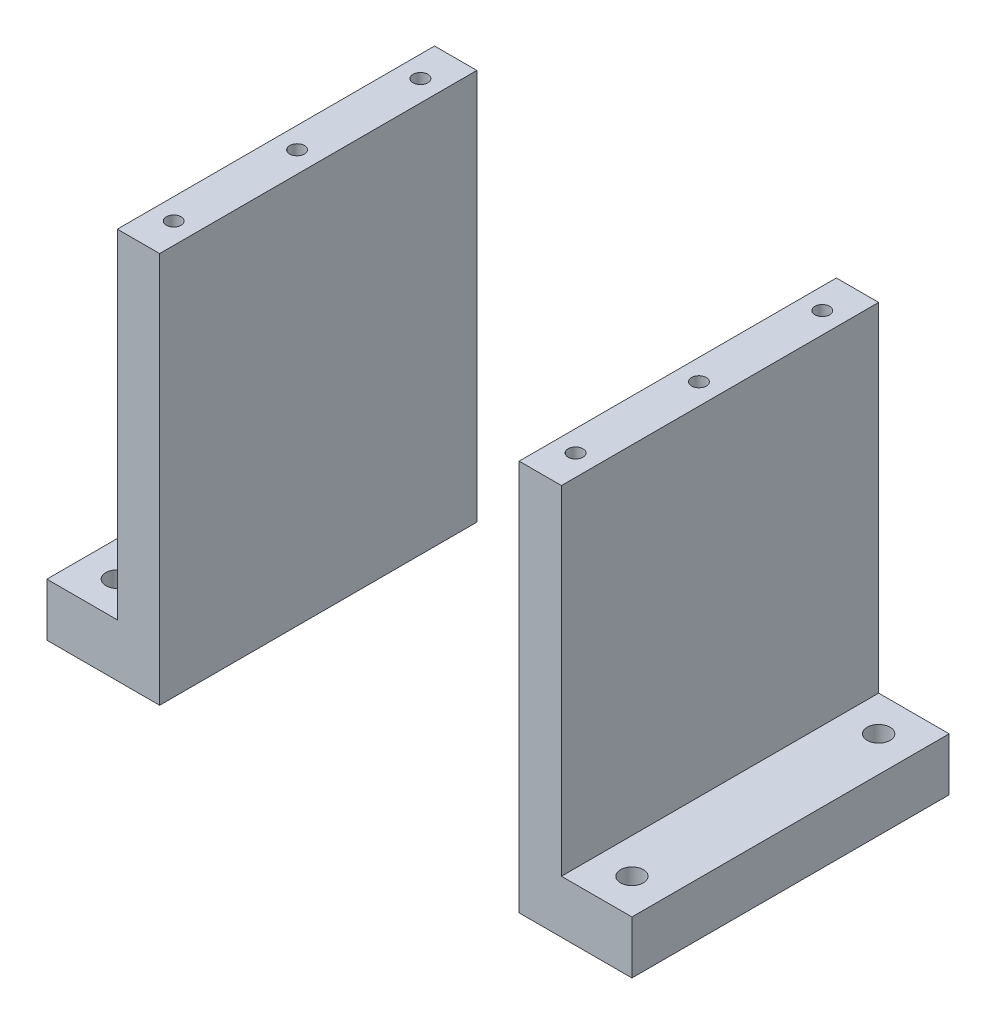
ISO-10303-21;
HEADER;
FILE_DESCRIPTION(('STEP AP214'),'2;1');
FILE_NAME('part.step','',(''),(''),'','','');
FILE_SCHEMA(('AUTOMOTIVE_DESIGN { 1 0 10303 214 1 1 1 1 }'));
ENDSEC;
DATA;
#1=APPLICATION_CONTEXT('core data for automotive mechanical design processes');
#2=APPLICATION_PROTOCOL_DEFINITION('international standard','automotive_design',2000,#1);
#3=PRODUCT_CONTEXT('',#1,'mechanical');
#4=PRODUCT('Part','Part','',(#3));
#5=PRODUCT_RELATED_PRODUCT_CATEGORY('part','',(#4));
#6=PRODUCT_DEFINITION_FORMATION('','',#4);
#7=PRODUCT_DEFINITION_CONTEXT('part definition',#1,'design');
#8=PRODUCT_DEFINITION('design','',#6,#7);
#9=PRODUCT_DEFINITION_SHAPE('','',#8);
#10=(LENGTH_UNIT() NAMED_UNIT(*) SI_UNIT(.MILLI.,.METRE.));
#11=(NAMED_UNIT(*) PLANE_ANGLE_UNIT() SI_UNIT($,.RADIAN.));
#12=(NAMED_UNIT(*) SI_UNIT($,.STERADIAN.) SOLID_ANGLE_UNIT());
#13=UNCERTAINTY_MEASURE_WITH_UNIT(LENGTH_MEASURE(1.E-05),#10,'distance_accuracy_value','');
#14=(GEOMETRIC_REPRESENTATION_CONTEXT(3) GLOBAL_UNCERTAINTY_ASSIGNED_CONTEXT((#13)) GLOBAL_UNIT_ASSIGNED_CONTEXT((#10,
#11,#12)) REPRESENTATION_CONTEXT('',''));
#15=CARTESIAN_POINT('',(0.,0.,0.));
#16=DIRECTION('',(0.,0.,1.));
#17=DIRECTION('',(1.,0.,0.));
#18=AXIS2_PLACEMENT_3D('',#15,#16,#17);
#19=CARTESIAN_POINT('',(134.000000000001,-2.27373675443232E-13,90.));
#20=DIRECTION('',(0.,1.,0.));
#21=DIRECTION('',(0.,0.,1.));
#22=AXIS2_PLACEMENT_3D('',#19,#20,#21);
#23=PLANE('',#22);
#24=CARTESIAN_POINT('',(156.000000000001,-2.35922392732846E-13,80.));
#25=DIRECTION('',(0.,1.,0.));
#26=DIRECTION('',(0.,0.,1.));
#27=AXIS2_PLACEMENT_3D('',#24,#25,#26);
#28=CIRCLE('',#27,3.25);
#29=CARTESIAN_POINT('',(156.000000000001,-2.4980018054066E-13,83.25));
#30=VERTEX_POINT('',#29);
#31=EDGE_CURVE('E130',#30,#30,#28,.T.);
#32=ORIENTED_EDGE('',*,*,#31,.T.);
#33=EDGE_LOOP('',(#32));
#34=FACE_BOUND('',#33,.T.);
#35=CARTESIAN_POINT('',(156.000000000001,-2.35922392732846E-13,10.));
#36=DIRECTION('',(0.,1.,0.));
#37=DIRECTION('',(0.,0.,1.));
#38=AXIS2_PLACEMENT_3D('',#35,#36,#37);
#39=CIRCLE('',#38,3.25);
#40=CARTESIAN_POINT('',(156.000000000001,-2.4980018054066E-13,13.25));
#41=VERTEX_POINT('',#40);
#42=EDGE_CURVE('E172',#41,#41,#39,.T.);
#43=ORIENTED_EDGE('',*,*,#42,.T.);
#44=EDGE_LOOP('',(#43));
#45=FACE_BOUND('',#44,.T.);
#46=DIRECTION('',(1.,0.,0.));
#47=VECTOR('',#46,1.);
#48=CARTESIAN_POINT('',(134.000000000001,-2.27373675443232E-13,0.));
#49=LINE('',#48,#47);
#50=CARTESIAN_POINT('',(134.000000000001,-2.27373675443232E-13,0.));
#51=VERTEX_POINT('',#50);
#52=CARTESIAN_POINT('',(166.000000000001,-2.27373675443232E-13,0.));
#53=VERTEX_POINT('',#52);
#54=EDGE_CURVE('E126',#51,#53,#49,.T.);
#55=ORIENTED_EDGE('',*,*,#54,.T.);
#56=DIRECTION('',(0.,0.,-1.));
#57=VECTOR('',#56,1.);
#58=CARTESIAN_POINT('',(166.000000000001,-2.27373675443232E-13,90.));
#59=LINE('',#58,#57);
#60=CARTESIAN_POINT('',(166.000000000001,-2.27373675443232E-13,90.));
#61=VERTEX_POINT('',#60);
#62=EDGE_CURVE('E12',#61,#53,#59,.T.);
#63=ORIENTED_EDGE('',*,*,#62,.F.);
#64=DIRECTION('',(1.,0.,0.));
#65=VECTOR('',#64,1.);
#66=CARTESIAN_POINT('',(134.000000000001,-2.27373675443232E-13,90.));
#67=LINE('',#66,#65);
#68=CARTESIAN_POINT('',(134.000000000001,-2.27373675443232E-13,90.));
#69=VERTEX_POINT('',#68);
#70=EDGE_CURVE('E137',#69,#61,#67,.T.);
#71=ORIENTED_EDGE('',*,*,#70,.F.);
#72=DIRECTION('',(0.,0.,-1.));
#73=VECTOR('',#72,1.);
#74=CARTESIAN_POINT('',(134.000000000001,-2.27373675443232E-13,90.));
#75=LINE('',#74,#73);
#76=EDGE_CURVE('E122',#69,#51,#75,.T.);
#77=ORIENTED_EDGE('',*,*,#76,.T.);
#78=EDGE_LOOP('',(#55,#63,#71,#77));
#79=FACE_BOUND('',#78,.T.);
#80=ADVANCED_FACE('F42',(#34,#45,#79),#23,.F.);
#81=CARTESIAN_POINT('',(166.000000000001,-2.27373675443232E-13,90.));
#82=DIRECTION('',(-1.,0.,0.));
#83=DIRECTION('',(0.,0.,1.));
#84=AXIS2_PLACEMENT_3D('',#81,#82,#83);
#85=PLANE('',#84);
#86=DIRECTION('',(0.,1.,0.));
#87=VECTOR('',#86,1.);
#88=CARTESIAN_POINT('',(166.000000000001,-2.27373675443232E-13,0.));
#89=LINE('',#88,#87);
#90=CARTESIAN_POINT('',(166.000000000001,15.,0.));
#91=VERTEX_POINT('',#90);
#92=EDGE_CURVE('E129',#53,#91,#89,.T.);
#93=ORIENTED_EDGE('',*,*,#92,.T.);
#94=DIRECTION('',(0.,0.,-1.));
#95=VECTOR('',#94,1.);
#96=CARTESIAN_POINT('',(166.000000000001,15.,90.));
#97=LINE('',#96,#95);
#98=CARTESIAN_POINT('',(166.000000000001,15.,90.));
#99=VERTEX_POINT('',#98);
#100=EDGE_CURVE('E50',#99,#91,#97,.T.);
#101=ORIENTED_EDGE('',*,*,#100,.F.);
#102=DIRECTION('',(0.,1.,0.));
#103=VECTOR('',#102,1.);
#104=CARTESIAN_POINT('',(166.000000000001,-2.27373675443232E-13,90.));
#105=LINE('',#104,#103);
#106=EDGE_CURVE('E95',#61,#99,#105,.T.);
#107=ORIENTED_EDGE('',*,*,#106,.F.);
#108=ORIENTED_EDGE('',*,*,#62,.T.);
#109=EDGE_LOOP('',(#93,#101,#107,#108));
#110=FACE_BOUND('',#109,.T.);
#111=ADVANCED_FACE('F162',(#110),#85,.F.);
#112=CARTESIAN_POINT('',(146.000000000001,15.,90.));
#113=DIRECTION('',(0.,-1.,0.));
#114=DIRECTION('',(0.,0.,-1.));
#115=AXIS2_PLACEMENT_3D('',#112,#113,#114);
#116=PLANE('',#115);
#117=CARTESIAN_POINT('',(156.000000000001,15.,80.));
#118=DIRECTION('',(0.,1.,0.));
#119=DIRECTION('',(0.,0.,1.));
#120=AXIS2_PLACEMENT_3D('',#117,#118,#119);
#121=CIRCLE('',#120,3.25);
#122=CARTESIAN_POINT('',(156.000000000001,15.,83.25));
#123=VERTEX_POINT('',#122);
#124=EDGE_CURVE('E174',#123,#123,#121,.T.);
#125=ORIENTED_EDGE('',*,*,#124,.F.);
#126=EDGE_LOOP('',(#125));
#127=FACE_BOUND('',#126,.T.);
#128=CARTESIAN_POINT('',(156.000000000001,15.,10.));
#129=DIRECTION('',(0.,1.,0.));
#130=DIRECTION('',(0.,0.,1.));
#131=AXIS2_PLACEMENT_3D('',#128,#129,#130);
#132=CIRCLE('',#131,3.25);
#133=CARTESIAN_POINT('',(156.000000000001,15.,13.25));
#134=VERTEX_POINT('',#133);
#135=EDGE_CURVE('E178',#134,#134,#132,.T.);
#136=ORIENTED_EDGE('',*,*,#135,.F.);
#137=EDGE_LOOP('',(#136));
#138=FACE_BOUND('',#137,.T.);
#139=DIRECTION('',(-1.,0.,0.));
#140=VECTOR('',#139,1.);
#141=CARTESIAN_POINT('',(146.000000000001,15.,0.));
#142=LINE('',#141,#140);
#143=CARTESIAN_POINT('',(146.000000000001,15.,0.));
#144=VERTEX_POINT('',#143);
#145=EDGE_CURVE('E132',#91,#144,#142,.T.);
#146=ORIENTED_EDGE('',*,*,#145,.T.);
#147=DIRECTION('',(0.,0.,-1.));
#148=VECTOR('',#147,1.);
#149=CARTESIAN_POINT('',(146.000000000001,15.,90.));
#150=LINE('',#149,#148);
#151=CARTESIAN_POINT('',(146.000000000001,15.,90.));
#152=VERTEX_POINT('',#151);
#153=EDGE_CURVE('E117',#152,#144,#150,.T.);
#154=ORIENTED_EDGE('',*,*,#153,.F.);
#155=DIRECTION('',(-1.,0.,0.));
#156=VECTOR('',#155,1.);
#157=CARTESIAN_POINT('',(146.000000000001,15.,90.));
#158=LINE('',#157,#156);
#159=EDGE_CURVE('E108',#99,#152,#158,.T.);
#160=ORIENTED_EDGE('',*,*,#159,.F.);
#161=ORIENTED_EDGE('',*,*,#100,.T.);
#162=EDGE_LOOP('',(#146,#154,#160,#161));
#163=FACE_BOUND('',#162,.T.);
#164=ADVANCED_FACE('F143',(#127,#138,#163),#116,.F.);
#165=CARTESIAN_POINT('',(146.000000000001,15.,90.));
#166=DIRECTION('',(-1.,0.,0.));
#167=DIRECTION('',(0.,0.,1.));
#168=AXIS2_PLACEMENT_3D('',#165,#166,#167);
#169=PLANE('',#168);
#170=DIRECTION('',(0.,1.,0.));
#171=VECTOR('',#170,1.);
#172=CARTESIAN_POINT('',(146.000000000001,15.,0.));
#173=LINE('',#172,#171);
#174=CARTESIAN_POINT('',(146.000000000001,111.,0.));
#175=VERTEX_POINT('',#174);
#176=EDGE_CURVE('E116',#144,#175,#173,.T.);
#177=ORIENTED_EDGE('',*,*,#176,.T.);
#178=DIRECTION('',(0.,0.,-1.));
#179=VECTOR('',#178,1.);
#180=CARTESIAN_POINT('',(146.000000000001,111.,90.));
#181=LINE('',#180,#179);
#182=CARTESIAN_POINT('',(146.000000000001,111.,90.));
#183=VERTEX_POINT('',#182);
#184=EDGE_CURVE('E113',#183,#175,#181,.T.);
#185=ORIENTED_EDGE('',*,*,#184,.F.);
#186=DIRECTION('',(0.,1.,0.));
#187=VECTOR('',#186,1.);
#188=CARTESIAN_POINT('',(146.000000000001,15.,90.));
#189=LINE('',#188,#187);
#190=EDGE_CURVE('E102',#152,#183,#189,.T.);
#191=ORIENTED_EDGE('',*,*,#190,.F.);
#192=ORIENTED_EDGE('',*,*,#153,.T.);
#193=EDGE_LOOP('',(#177,#185,#191,#192));
#194=FACE_BOUND('',#193,.T.);
#195=ADVANCED_FACE('F114',(#194),#169,.F.);
#196=CARTESIAN_POINT('',(134.000000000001,111.,90.));
#197=DIRECTION('',(0.,-1.,0.));
#198=DIRECTION('',(0.,0.,-1.));
#199=AXIS2_PLACEMENT_3D('',#196,#197,#198);
#200=PLANE('',#199);
#201=CARTESIAN_POINT('',(140.000000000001,111.,80.));
#202=DIRECTION('',(0.,1.,0.));
#203=DIRECTION('',(0.,0.,1.));
#204=AXIS2_PLACEMENT_3D('',#201,#202,#203);
#205=CIRCLE('',#204,2.09999999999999);
#206=CARTESIAN_POINT('',(140.000000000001,111.,82.1));
#207=VERTEX_POINT('',#206);
#208=EDGE_CURVE('E198',#207,#207,#205,.T.);
#209=ORIENTED_EDGE('',*,*,#208,.F.);
#210=EDGE_LOOP('',(#209));
#211=FACE_BOUND('',#210,.T.);
#212=CARTESIAN_POINT('',(140.000000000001,111.,45.));
#213=DIRECTION('',(0.,1.,0.));
#214=DIRECTION('',(0.,0.,1.));
#215=AXIS2_PLACEMENT_3D('',#212,#213,#214);
#216=CIRCLE('',#215,2.09999999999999);
#217=CARTESIAN_POINT('',(140.000000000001,111.,47.1));
#218=VERTEX_POINT('',#217);
#219=EDGE_CURVE('E192',#218,#218,#216,.T.);
#220=ORIENTED_EDGE('',*,*,#219,.F.);
#221=EDGE_LOOP('',(#220));
#222=FACE_BOUND('',#221,.T.);
#223=CARTESIAN_POINT('',(140.000000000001,111.,10.));
#224=DIRECTION('',(0.,1.,0.));
#225=DIRECTION('',(0.,0.,1.));
#226=AXIS2_PLACEMENT_3D('',#223,#224,#225);
#227=CIRCLE('',#226,2.09999999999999);
#228=CARTESIAN_POINT('',(140.000000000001,111.,12.1));
#229=VERTEX_POINT('',#228);
#230=EDGE_CURVE('E186',#229,#229,#227,.T.);
#231=ORIENTED_EDGE('',*,*,#230,.F.);
#232=EDGE_LOOP('',(#231));
#233=FACE_BOUND('',#232,.T.);
#234=DIRECTION('',(-1.,0.,0.));
#235=VECTOR('',#234,1.);
#236=CARTESIAN_POINT('',(134.000000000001,111.,0.));
#237=LINE('',#236,#235);
#238=CARTESIAN_POINT('',(134.000000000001,111.,0.));
#239=VERTEX_POINT('',#238);
#240=EDGE_CURVE('E81',#175,#239,#237,.T.);
#241=ORIENTED_EDGE('',*,*,#240,.T.);
#242=DIRECTION('',(0.,0.,-1.));
#243=VECTOR('',#242,1.);
#244=CARTESIAN_POINT('',(134.000000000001,111.,90.));
#245=LINE('',#244,#243);
#246=CARTESIAN_POINT('',(134.000000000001,111.,90.));
#247=VERTEX_POINT('',#246);
#248=EDGE_CURVE('E118',#247,#239,#245,.T.);
#249=ORIENTED_EDGE('',*,*,#248,.F.);
#250=DIRECTION('',(-1.,0.,0.));
#251=VECTOR('',#250,1.);
#252=CARTESIAN_POINT('',(134.000000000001,111.,90.));
#253=LINE('',#252,#251);
#254=EDGE_CURVE('E106',#183,#247,#253,.T.);
#255=ORIENTED_EDGE('',*,*,#254,.F.);
#256=ORIENTED_EDGE('',*,*,#184,.T.);
#257=EDGE_LOOP('',(#241,#249,#255,#256));
#258=FACE_BOUND('',#257,.T.);
#259=ADVANCED_FACE('F120',(#211,#222,#233,#258),#200,.F.);
#260=CARTESIAN_POINT('',(134.000000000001,-2.27373675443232E-13,90.));
#261=DIRECTION('',(1.,0.,0.));
#262=DIRECTION('',(0.,0.,-1.));
#263=AXIS2_PLACEMENT_3D('',#260,#261,#262);
#264=PLANE('',#263);
#265=DIRECTION('',(0.,-1.,0.));
#266=VECTOR('',#265,1.);
#267=CARTESIAN_POINT('',(134.000000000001,-2.27373675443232E-13,0.));
#268=LINE('',#267,#266);
#269=EDGE_CURVE('E87',#239,#51,#268,.T.);
#270=ORIENTED_EDGE('',*,*,#269,.T.);
#271=ORIENTED_EDGE('',*,*,#76,.F.);
#272=DIRECTION('',(0.,-1.,0.));
#273=VECTOR('',#272,1.);
#274=CARTESIAN_POINT('',(134.000000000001,-2.27373675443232E-13,90.));
#275=LINE('',#274,#273);
#276=EDGE_CURVE('E58',#247,#69,#275,.T.);
#277=ORIENTED_EDGE('',*,*,#276,.F.);
#278=ORIENTED_EDGE('',*,*,#248,.T.);
#279=EDGE_LOOP('',(#270,#271,#277,#278));
#280=FACE_BOUND('',#279,.T.);
#281=ADVANCED_FACE('F150',(#280),#264,.F.);
#282=CARTESIAN_POINT('',(166.000000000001,-2.27373675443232E-13,90.));
#283=DIRECTION('',(0.,0.,1.));
#284=DIRECTION('',(1.,0.,0.));
#285=AXIS2_PLACEMENT_3D('',#282,#283,#284);
#286=PLANE('',#285);
#287=ORIENTED_EDGE('',*,*,#70,.T.);
#288=ORIENTED_EDGE('',*,*,#106,.T.);
#289=ORIENTED_EDGE('',*,*,#159,.T.);
#290=ORIENTED_EDGE('',*,*,#190,.T.);
#291=ORIENTED_EDGE('',*,*,#254,.T.);
#292=ORIENTED_EDGE('',*,*,#276,.T.);
#293=EDGE_LOOP('',(#287,#288,#289,#290,#291,#292));
#294=FACE_BOUND('',#293,.T.);
#295=ADVANCED_FACE('F104',(#294),#286,.T.);
#296=CARTESIAN_POINT('',(166.000000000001,-2.27373675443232E-13,0.));
#297=DIRECTION('',(0.,0.,1.));
#298=DIRECTION('',(1.,0.,0.));
#299=AXIS2_PLACEMENT_3D('',#296,#297,#298);
#300=PLANE('',#299);
#301=ORIENTED_EDGE('',*,*,#54,.F.);
#302=ORIENTED_EDGE('',*,*,#269,.F.);
#303=ORIENTED_EDGE('',*,*,#240,.F.);
#304=ORIENTED_EDGE('',*,*,#176,.F.);
#305=ORIENTED_EDGE('',*,*,#145,.F.);
#306=ORIENTED_EDGE('',*,*,#92,.F.);
#307=EDGE_LOOP('',(#301,#302,#303,#304,#305,#306));
#308=FACE_BOUND('',#307,.T.);
#309=ADVANCED_FACE('F146',(#308),#300,.F.);
#310=CARTESIAN_POINT('',(156.000000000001,-75.,10.));
#311=DIRECTION('',(0.,1.,0.));
#312=DIRECTION('',(0.,0.,1.));
#313=AXIS2_PLACEMENT_3D('',#310,#311,#312);
#314=CYLINDRICAL_SURFACE('',#313,3.25);
#315=CARTESIAN_POINT('',(156.000000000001,15.,13.25));
#316=CARTESIAN_POINT('',(156.000000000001,14.84375,13.25));
#317=CARTESIAN_POINT('',(156.000000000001,14.6875,13.25));
#318=CARTESIAN_POINT('',(156.000000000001,14.375,13.25));
#319=CARTESIAN_POINT('',(156.000000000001,14.21875,13.25));
#320=CARTESIAN_POINT('',(156.000000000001,13.90625,13.25));
#321=CARTESIAN_POINT('',(156.000000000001,13.75,13.25));
#322=CARTESIAN_POINT('',(156.000000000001,13.4375,13.25));
#323=CARTESIAN_POINT('',(156.000000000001,13.28125,13.25));
#324=CARTESIAN_POINT('',(156.000000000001,12.96875,13.25));
#325=CARTESIAN_POINT('',(156.000000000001,12.8125,13.25));
#326=CARTESIAN_POINT('',(156.000000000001,12.4999999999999,13.25));
#327=CARTESIAN_POINT('',(156.000000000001,12.3437499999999,13.25));
#328=CARTESIAN_POINT('',(156.000000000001,12.0312499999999,13.25));
#329=CARTESIAN_POINT('',(156.000000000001,11.8749999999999,13.25));
#330=CARTESIAN_POINT('',(156.000000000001,11.5624999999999,13.25));
#331=CARTESIAN_POINT('',(156.000000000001,11.4062499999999,13.25));
#332=CARTESIAN_POINT('',(156.000000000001,11.0937499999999,13.25));
#333=CARTESIAN_POINT('',(156.000000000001,10.9374999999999,13.25));
#334=CARTESIAN_POINT('',(156.000000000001,10.6249999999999,13.25));
#335=CARTESIAN_POINT('',(156.000000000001,10.4687499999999,13.25));
#336=CARTESIAN_POINT('',(156.000000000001,10.1562499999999,13.25));
#337=CARTESIAN_POINT('',(156.000000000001,9.99999999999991,13.25));
#338=CARTESIAN_POINT('',(156.000000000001,9.6874999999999,13.25));
#339=CARTESIAN_POINT('',(156.000000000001,9.5312499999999,13.25));
#340=CARTESIAN_POINT('',(156.000000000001,9.2187499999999,13.25));
#341=CARTESIAN_POINT('',(156.000000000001,9.0624999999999,13.25));
#342=CARTESIAN_POINT('',(156.000000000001,8.74999999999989,13.25));
#343=CARTESIAN_POINT('',(156.000000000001,8.59374999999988,13.25));
#344=CARTESIAN_POINT('',(156.000000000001,8.28124999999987,13.25));
#345=CARTESIAN_POINT('',(156.000000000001,8.12499999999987,13.25));
#346=CARTESIAN_POINT('',(156.000000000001,7.81249999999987,13.25));
#347=CARTESIAN_POINT('',(156.000000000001,7.65624999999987,13.25));
#348=CARTESIAN_POINT('',(156.000000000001,7.34374999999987,13.25));
#349=CARTESIAN_POINT('',(156.000000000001,7.18749999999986,13.25));
#350=CARTESIAN_POINT('',(156.000000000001,6.87499999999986,13.25));
#351=CARTESIAN_POINT('',(156.000000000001,6.71874999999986,13.25));
#352=CARTESIAN_POINT('',(156.000000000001,6.40624999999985,13.25));
#353=CARTESIAN_POINT('',(156.000000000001,6.24999999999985,13.25));
#354=CARTESIAN_POINT('',(156.000000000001,5.93749999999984,13.25));
#355=CARTESIAN_POINT('',(156.000000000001,5.78124999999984,13.25));
#356=CARTESIAN_POINT('',(156.000000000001,5.46874999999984,13.25));
#357=CARTESIAN_POINT('',(156.000000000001,5.31249999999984,13.25));
#358=CARTESIAN_POINT('',(156.000000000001,4.99999999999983,13.25));
#359=CARTESIAN_POINT('',(156.000000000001,4.84374999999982,13.25));
#360=CARTESIAN_POINT('',(156.000000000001,4.53124999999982,13.25));
#361=CARTESIAN_POINT('',(156.000000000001,4.37499999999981,13.25));
#362=CARTESIAN_POINT('',(156.000000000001,4.06249999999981,13.25));
#363=CARTESIAN_POINT('',(156.000000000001,3.90624999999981,13.25));
#364=CARTESIAN_POINT('',(156.000000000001,3.59374999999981,13.25));
#365=CARTESIAN_POINT('',(156.000000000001,3.43749999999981,13.25));
#366=CARTESIAN_POINT('',(156.000000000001,3.1249999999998,13.25));
#367=CARTESIAN_POINT('',(156.000000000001,2.9687499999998,13.25));
#368=CARTESIAN_POINT('',(156.000000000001,2.6562499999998,13.25));
#369=CARTESIAN_POINT('',(156.000000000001,2.49999999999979,13.25));
#370=CARTESIAN_POINT('',(156.000000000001,2.18749999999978,13.25));
#371=CARTESIAN_POINT('',(156.000000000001,2.03124999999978,13.25));
#372=CARTESIAN_POINT('',(156.000000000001,1.71874999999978,13.25));
#373=CARTESIAN_POINT('',(156.000000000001,1.56249999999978,13.25));
#374=CARTESIAN_POINT('',(156.000000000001,1.24999999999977,13.25));
#375=CARTESIAN_POINT('',(156.000000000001,1.09374999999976,13.25));
#376=CARTESIAN_POINT('',(156.000000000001,0.781249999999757,13.25));
#377=CARTESIAN_POINT('',(156.000000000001,0.624999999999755,13.25));
#378=CARTESIAN_POINT('',(156.000000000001,0.312499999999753,13.25));
#379=CARTESIAN_POINT('',(156.000000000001,0.156249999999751,13.25));
#380=CARTESIAN_POINT('',(156.000000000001,-2.4980018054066E-13,13.25));
#381=B_SPLINE_CURVE_WITH_KNOTS('',3,(#315,#316,#317,#318,#319,#320,#321,#322,#323,#324,#325,
#326,#327,#328,#329,#330,#331,#332,#333,#334,#335,#336,#337,#338,#339,#340,#341,#342,#343,#344,
#345,#346,#347,#348,#349,#350,#351,#352,#353,#354,#355,#356,#357,#358,#359,#360,#361,#362,#363,
#364,#365,#366,#367,#368,#369,#370,#371,#372,#373,#374,#375,#376,#377,#378,#379,#380),
.UNSPECIFIED.,.F.,.F.,(4,2,2,2,2,2,2,2,2,2,2,2,2,2,2,2,2,2,2,2,2,2,2,2,2,2,2,2,2,2,2,2,4),(0.,
0.468750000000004,0.937500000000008,1.40625000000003,1.87500000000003,2.34375000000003,
2.81250000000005,3.28125000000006,3.75000000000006,4.21875000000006,4.68750000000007,
5.15625000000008,5.62500000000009,6.09375000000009,6.56250000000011,7.03125000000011,
7.50000000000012,7.96875000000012,8.43750000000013,8.90625000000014,9.37500000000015,
9.84375000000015,10.3125000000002,10.7812500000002,11.2500000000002,11.7187500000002,
12.1875000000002,12.6562500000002,13.1250000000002,13.5937500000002,14.0625000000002,
14.5312500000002,15.0000000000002),.UNSPECIFIED.);
#382=EDGE_CURVE('BSEAM230',#134,#41,#381,.T.);
#383=ORIENTED_EDGE('',*,*,#135,.T.);
#384=ORIENTED_EDGE('',*,*,#42,.F.);
#385=ORIENTED_EDGE('',*,*,#382,.T.);
#386=ORIENTED_EDGE('',*,*,#382,.F.);
#387=EDGE_LOOP('',(#383,#385,#384,#386));
#388=FACE_BOUND('',#387,.T.);
#389=ADVANCED_FACE('F230',(#388),#314,.F.);
#390=CARTESIAN_POINT('',(156.000000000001,-75.,80.));
#391=DIRECTION('',(0.,1.,0.));
#392=DIRECTION('',(0.,0.,1.));
#393=AXIS2_PLACEMENT_3D('',#390,#391,#392);
#394=CYLINDRICAL_SURFACE('',#393,3.25);
#395=CARTESIAN_POINT('',(156.000000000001,15.,83.25));
#396=CARTESIAN_POINT('',(156.000000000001,14.84375,83.25));
#397=CARTESIAN_POINT('',(156.000000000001,14.6875,83.25));
#398=CARTESIAN_POINT('',(156.000000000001,14.375,83.25));
#399=CARTESIAN_POINT('',(156.000000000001,14.21875,83.25));
#400=CARTESIAN_POINT('',(156.000000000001,13.90625,83.25));
#401=CARTESIAN_POINT('',(156.000000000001,13.75,83.25));
#402=CARTESIAN_POINT('',(156.000000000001,13.4375,83.25));
#403=CARTESIAN_POINT('',(156.000000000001,13.28125,83.25));
#404=CARTESIAN_POINT('',(156.000000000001,12.96875,83.25));
#405=CARTESIAN_POINT('',(156.000000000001,12.8125,83.25));
#406=CARTESIAN_POINT('',(156.000000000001,12.4999999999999,83.25));
#407=CARTESIAN_POINT('',(156.000000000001,12.3437499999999,83.25));
#408=CARTESIAN_POINT('',(156.000000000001,12.0312499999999,83.25));
#409=CARTESIAN_POINT('',(156.000000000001,11.8749999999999,83.25));
#410=CARTESIAN_POINT('',(156.000000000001,11.5624999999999,83.25));
#411=CARTESIAN_POINT('',(156.000000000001,11.4062499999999,83.25));
#412=CARTESIAN_POINT('',(156.000000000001,11.0937499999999,83.25));
#413=CARTESIAN_POINT('',(156.000000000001,10.9374999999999,83.25));
#414=CARTESIAN_POINT('',(156.000000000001,10.6249999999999,83.25));
#415=CARTESIAN_POINT('',(156.000000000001,10.4687499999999,83.25));
#416=CARTESIAN_POINT('',(156.000000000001,10.1562499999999,83.25));
#417=CARTESIAN_POINT('',(156.000000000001,9.99999999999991,83.25));
#418=CARTESIAN_POINT('',(156.000000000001,9.6874999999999,83.25));
#419=CARTESIAN_POINT('',(156.000000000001,9.5312499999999,83.25));
#420=CARTESIAN_POINT('',(156.000000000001,9.2187499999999,83.25));
#421=CARTESIAN_POINT('',(156.000000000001,9.0624999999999,83.25));
#422=CARTESIAN_POINT('',(156.000000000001,8.74999999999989,83.25));
#423=CARTESIAN_POINT('',(156.000000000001,8.59374999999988,83.25));
#424=CARTESIAN_POINT('',(156.000000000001,8.28124999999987,83.25));
#425=CARTESIAN_POINT('',(156.000000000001,8.12499999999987,83.25));
#426=CARTESIAN_POINT('',(156.000000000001,7.81249999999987,83.25));
#427=CARTESIAN_POINT('',(156.000000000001,7.65624999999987,83.25));
#428=CARTESIAN_POINT('',(156.000000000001,7.34374999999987,83.25));
#429=CARTESIAN_POINT('',(156.000000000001,7.18749999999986,83.25));
#430=CARTESIAN_POINT('',(156.000000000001,6.87499999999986,83.25));
#431=CARTESIAN_POINT('',(156.000000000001,6.71874999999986,83.25));
#432=CARTESIAN_POINT('',(156.000000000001,6.40624999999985,83.25));
#433=CARTESIAN_POINT('',(156.000000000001,6.24999999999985,83.25));
#434=CARTESIAN_POINT('',(156.000000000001,5.93749999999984,83.25));
#435=CARTESIAN_POINT('',(156.000000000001,5.78124999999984,83.25));
#436=CARTESIAN_POINT('',(156.000000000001,5.46874999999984,83.25));
#437=CARTESIAN_POINT('',(156.000000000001,5.31249999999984,83.25));
#438=CARTESIAN_POINT('',(156.000000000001,4.99999999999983,83.25));
#439=CARTESIAN_POINT('',(156.000000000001,4.84374999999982,83.25));
#440=CARTESIAN_POINT('',(156.000000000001,4.53124999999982,83.25));
#441=CARTESIAN_POINT('',(156.000000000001,4.37499999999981,83.25));
#442=CARTESIAN_POINT('',(156.000000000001,4.06249999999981,83.25));
#443=CARTESIAN_POINT('',(156.000000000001,3.90624999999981,83.25));
#444=CARTESIAN_POINT('',(156.000000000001,3.59374999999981,83.25));
#445=CARTESIAN_POINT('',(156.000000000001,3.43749999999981,83.25));
#446=CARTESIAN_POINT('',(156.000000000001,3.1249999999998,83.25));
#447=CARTESIAN_POINT('',(156.000000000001,2.9687499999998,83.25));
#448=CARTESIAN_POINT('',(156.000000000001,2.6562499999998,83.25));
#449=CARTESIAN_POINT('',(156.000000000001,2.49999999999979,83.25));
#450=CARTESIAN_POINT('',(156.000000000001,2.18749999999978,83.25));
#451=CARTESIAN_POINT('',(156.000000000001,2.03124999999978,83.25));
#452=CARTESIAN_POINT('',(156.000000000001,1.71874999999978,83.25));
#453=CARTESIAN_POINT('',(156.000000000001,1.56249999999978,83.25));
#454=CARTESIAN_POINT('',(156.000000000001,1.24999999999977,83.25));
#455=CARTESIAN_POINT('',(156.000000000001,1.09374999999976,83.25));
#456=CARTESIAN_POINT('',(156.000000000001,0.781249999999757,83.25));
#457=CARTESIAN_POINT('',(156.000000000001,0.624999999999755,83.25));
#458=CARTESIAN_POINT('',(156.000000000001,0.312499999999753,83.25));
#459=CARTESIAN_POINT('',(156.000000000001,0.156249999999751,83.25));
#460=CARTESIAN_POINT('',(156.000000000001,-2.4980018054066E-13,83.25));
#461=B_SPLINE_CURVE_WITH_KNOTS('',3,(#395,#396,#397,#398,#399,#400,#401,#402,#403,#404,#405,
#406,#407,#408,#409,#410,#411,#412,#413,#414,#415,#416,#417,#418,#419,#420,#421,#422,#423,#424,
#425,#426,#427,#428,#429,#430,#431,#432,#433,#434,#435,#436,#437,#438,#439,#440,#441,#442,#443,
#444,#445,#446,#447,#448,#449,#450,#451,#452,#453,#454,#455,#456,#457,#458,#459,#460),
.UNSPECIFIED.,.F.,.F.,(4,2,2,2,2,2,2,2,2,2,2,2,2,2,2,2,2,2,2,2,2,2,2,2,2,2,2,2,2,2,2,2,4),(0.,
0.468750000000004,0.937500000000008,1.40625000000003,1.87500000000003,2.34375000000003,
2.81250000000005,3.28125000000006,3.75000000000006,4.21875000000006,4.68750000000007,
5.15625000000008,5.62500000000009,6.09375000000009,6.56250000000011,7.03125000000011,
7.50000000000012,7.96875000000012,8.43750000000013,8.90625000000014,9.37500000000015,
9.84375000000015,10.3125000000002,10.7812500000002,11.2500000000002,11.7187500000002,
12.1875000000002,12.6562500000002,13.1250000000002,13.5937500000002,14.0625000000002,
14.5312500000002,15.0000000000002),.UNSPECIFIED.);
#462=EDGE_CURVE('BSEAM220',#123,#30,#461,.T.);
#463=ORIENTED_EDGE('',*,*,#124,.T.);
#464=ORIENTED_EDGE('',*,*,#31,.F.);
#465=ORIENTED_EDGE('',*,*,#462,.T.);
#466=ORIENTED_EDGE('',*,*,#462,.F.);
#467=EDGE_LOOP('',(#463,#465,#464,#466));
#468=FACE_BOUND('',#467,.T.);
#469=ADVANCED_FACE('F220',(#468),#394,.F.);
#470=CARTESIAN_POINT('',(140.000000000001,95.9999999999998,10.));
#471=DIRECTION('',(0.,1.,0.));
#472=DIRECTION('',(0.,0.,1.));
#473=AXIS2_PLACEMENT_3D('',#470,#471,#472);
#474=CYLINDRICAL_SURFACE('',#473,2.09999999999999);
#475=CARTESIAN_POINT('',(140.000000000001,95.9999999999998,10.));
#476=DIRECTION('',(0.,1.,0.));
#477=DIRECTION('',(0.,0.,1.));
#478=AXIS2_PLACEMENT_3D('',#475,#476,#477);
#479=CIRCLE('',#478,2.09999999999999);
#480=CARTESIAN_POINT('',(140.000000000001,95.9999999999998,12.1));
#481=VERTEX_POINT('',#480);
#482=EDGE_CURVE('E189',#481,#481,#479,.T.);
#483=ORIENTED_EDGE('',*,*,#482,.F.);
#484=EDGE_LOOP('',(#483));
#485=FACE_BOUND('',#484,.T.);
#486=ORIENTED_EDGE('',*,*,#230,.T.);
#487=EDGE_LOOP('',(#486));
#488=FACE_BOUND('',#487,.T.);
#489=ADVANCED_FACE('F217',(#485,#488),#474,.F.);
#490=CARTESIAN_POINT('',(140.000000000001,95.9999999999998,10.));
#491=DIRECTION('',(0.,1.,0.));
#492=DIRECTION('',(0.,0.,1.));
#493=AXIS2_PLACEMENT_3D('',#490,#491,#492);
#494=PLANE('',#493);
#495=ORIENTED_EDGE('',*,*,#482,.T.);
#496=EDGE_LOOP('',(#495));
#497=FACE_BOUND('',#496,.T.);
#498=ADVANCED_FACE('F219',(#497),#494,.T.);
#499=CARTESIAN_POINT('',(140.000000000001,95.9999999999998,45.));
#500=DIRECTION('',(0.,1.,0.));
#501=DIRECTION('',(0.,0.,1.));
#502=AXIS2_PLACEMENT_3D('',#499,#500,#501);
#503=CYLINDRICAL_SURFACE('',#502,2.09999999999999);
#504=CARTESIAN_POINT('',(140.000000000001,95.9999999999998,45.));
#505=DIRECTION('',(0.,1.,0.));
#506=DIRECTION('',(0.,0.,1.));
#507=AXIS2_PLACEMENT_3D('',#504,#505,#506);
#508=CIRCLE('',#507,2.09999999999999);
#509=CARTESIAN_POINT('',(140.000000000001,95.9999999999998,47.1));
#510=VERTEX_POINT('',#509);
#511=EDGE_CURVE('E195',#510,#510,#508,.T.);
#512=ORIENTED_EDGE('',*,*,#511,.F.);
#513=EDGE_LOOP('',(#512));
#514=FACE_BOUND('',#513,.T.);
#515=ORIENTED_EDGE('',*,*,#219,.T.);
#516=EDGE_LOOP('',(#515));
#517=FACE_BOUND('',#516,.T.);
#518=ADVANCED_FACE('F227',(#514,#517),#503,.F.);
#519=CARTESIAN_POINT('',(140.000000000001,95.9999999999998,45.));
#520=DIRECTION('',(0.,1.,0.));
#521=DIRECTION('',(0.,0.,1.));
#522=AXIS2_PLACEMENT_3D('',#519,#520,#521);
#523=PLANE('',#522);
#524=ORIENTED_EDGE('',*,*,#511,.T.);
#525=EDGE_LOOP('',(#524));
#526=FACE_BOUND('',#525,.T.);
#527=ADVANCED_FACE('F209',(#526),#523,.T.);
#528=CARTESIAN_POINT('',(140.000000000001,95.9999999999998,80.));
#529=DIRECTION('',(0.,1.,0.));
#530=DIRECTION('',(0.,0.,1.));
#531=AXIS2_PLACEMENT_3D('',#528,#529,#530);
#532=CYLINDRICAL_SURFACE('',#531,2.09999999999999);
#533=CARTESIAN_POINT('',(140.000000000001,95.9999999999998,80.));
#534=DIRECTION('',(0.,1.,0.));
#535=DIRECTION('',(0.,0.,1.));
#536=AXIS2_PLACEMENT_3D('',#533,#534,#535);
#537=CIRCLE('',#536,2.09999999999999);
#538=CARTESIAN_POINT('',(140.000000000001,95.9999999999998,82.1));
#539=VERTEX_POINT('',#538);
#540=EDGE_CURVE('E184',#539,#539,#537,.T.);
#541=ORIENTED_EDGE('',*,*,#540,.F.);
#542=EDGE_LOOP('',(#541));
#543=FACE_BOUND('',#542,.T.);
#544=ORIENTED_EDGE('',*,*,#208,.T.);
#545=EDGE_LOOP('',(#544));
#546=FACE_BOUND('',#545,.T.);
#547=ADVANCED_FACE('F206',(#543,#546),#532,.F.);
#548=CARTESIAN_POINT('',(140.000000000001,95.9999999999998,80.));
#549=DIRECTION('',(0.,1.,0.));
#550=DIRECTION('',(0.,0.,1.));
#551=AXIS2_PLACEMENT_3D('',#548,#549,#550);
#552=PLANE('',#551);
#553=ORIENTED_EDGE('',*,*,#540,.T.);
#554=EDGE_LOOP('',(#553));
#555=FACE_BOUND('',#554,.T.);
#556=ADVANCED_FACE('F204',(#555),#552,.T.);
#557=CLOSED_SHELL('',(#80,#111,#164,#195,#259,#281,#295,#309,#389,#469,#489,#498,#518,#527,#547,#556));
#558=MANIFOLD_SOLID_BREP('B2',#557);
#559=CARTESIAN_POINT('',(0.,15.,90.));
#560=DIRECTION('',(0.,-1.,0.));
#561=DIRECTION('',(0.,0.,-1.));
#562=AXIS2_PLACEMENT_3D('',#559,#560,#561);
#563=PLANE('',#562);
#564=CARTESIAN_POINT('',(10.,15.,10.));
#565=DIRECTION('',(0.,1.,0.));
#566=DIRECTION('',(0.,0.,1.));
#567=AXIS2_PLACEMENT_3D('',#564,#565,#566);
#568=CIRCLE('',#567,3.25);
#569=CARTESIAN_POINT('',(10.,15.,13.25));
#570=VERTEX_POINT('',#569);
#571=EDGE_CURVE('E452',#570,#570,#568,.T.);
#572=ORIENTED_EDGE('',*,*,#571,.F.);
#573=EDGE_LOOP('',(#572));
#574=FACE_BOUND('',#573,.T.);
#575=CARTESIAN_POINT('',(10.,15.,80.));
#576=DIRECTION('',(0.,1.,0.));
#577=DIRECTION('',(0.,0.,1.));
#578=AXIS2_PLACEMENT_3D('',#575,#576,#577);
#579=CIRCLE('',#578,3.25);
#580=CARTESIAN_POINT('',(10.,15.,83.25));
#581=VERTEX_POINT('',#580);
#582=EDGE_CURVE('E457',#581,#581,#579,.T.);
#583=ORIENTED_EDGE('',*,*,#582,.F.);
#584=EDGE_LOOP('',(#583));
#585=FACE_BOUND('',#584,.T.);
#586=DIRECTION('',(-1.,0.,0.));
#587=VECTOR('',#586,1.);
#588=CARTESIAN_POINT('',(0.,15.,0.));
#589=LINE('',#588,#587);
#590=CARTESIAN_POINT('',(20.,15.,0.));
#591=VERTEX_POINT('',#590);
#592=CARTESIAN_POINT('',(0.,15.,0.));
#593=VERTEX_POINT('',#592);
#594=EDGE_CURVE('E435',#591,#593,#589,.T.);
#595=ORIENTED_EDGE('',*,*,#594,.T.);
#596=DIRECTION('',(0.,0.,-1.));
#597=VECTOR('',#596,1.);
#598=CARTESIAN_POINT('',(0.,15.,90.));
#599=LINE('',#598,#597);
#600=CARTESIAN_POINT('',(0.,15.,90.));
#601=VERTEX_POINT('',#600);
#602=EDGE_CURVE('E40',#601,#593,#599,.T.);
#603=ORIENTED_EDGE('',*,*,#602,.F.);
#604=DIRECTION('',(-1.,0.,0.));
#605=VECTOR('',#604,1.);
#606=CARTESIAN_POINT('',(0.,15.,90.));
#607=LINE('',#606,#605);
#608=CARTESIAN_POINT('',(20.,15.,90.));
#609=VERTEX_POINT('',#608);
#610=EDGE_CURVE('E445',#609,#601,#607,.T.);
#611=ORIENTED_EDGE('',*,*,#610,.F.);
#612=DIRECTION('',(0.,0.,-1.));
#613=VECTOR('',#612,1.);
#614=CARTESIAN_POINT('',(20.,15.,90.));
#615=LINE('',#614,#613);
#616=EDGE_CURVE('E431',#609,#591,#615,.T.);
#617=ORIENTED_EDGE('',*,*,#616,.T.);
#618=EDGE_LOOP('',(#595,#603,#611,#617));
#619=FACE_BOUND('',#618,.T.);
#620=ADVANCED_FACE('F349',(#574,#585,#619),#563,.F.);
#621=CARTESIAN_POINT('',(0.,0.,90.));
#622=DIRECTION('',(1.,0.,0.));
#623=DIRECTION('',(0.,0.,-1.));
#624=AXIS2_PLACEMENT_3D('',#621,#622,#623);
#625=PLANE('',#624);
#626=DIRECTION('',(0.,-1.,0.));
#627=VECTOR('',#626,1.);
#628=CARTESIAN_POINT('',(0.,0.,0.));
#629=LINE('',#628,#627);
#630=CARTESIAN_POINT('',(0.,0.,0.));
#631=VERTEX_POINT('',#630);
#632=EDGE_CURVE('E438',#593,#631,#629,.T.);
#633=ORIENTED_EDGE('',*,*,#632,.T.);
#634=DIRECTION('',(0.,0.,-1.));
#635=VECTOR('',#634,1.);
#636=CARTESIAN_POINT('',(0.,0.,90.));
#637=LINE('',#636,#635);
#638=CARTESIAN_POINT('',(0.,0.,90.));
#639=VERTEX_POINT('',#638);
#640=EDGE_CURVE('E358',#639,#631,#637,.T.);
#641=ORIENTED_EDGE('',*,*,#640,.F.);
#642=DIRECTION('',(0.,-1.,0.));
#643=VECTOR('',#642,1.);
#644=CARTESIAN_POINT('',(0.,0.,90.));
#645=LINE('',#644,#643);
#646=EDGE_CURVE('E404',#601,#639,#645,.T.);
#647=ORIENTED_EDGE('',*,*,#646,.F.);
#648=ORIENTED_EDGE('',*,*,#602,.T.);
#649=EDGE_LOOP('',(#633,#641,#647,#648));
#650=FACE_BOUND('',#649,.T.);
#651=ADVANCED_FACE('F471',(#650),#625,.F.);
#652=CARTESIAN_POINT('',(0.,0.,90.));
#653=DIRECTION('',(0.,1.,0.));
#654=DIRECTION('',(0.,0.,1.));
#655=AXIS2_PLACEMENT_3D('',#652,#653,#654);
#656=PLANE('',#655);
#657=CARTESIAN_POINT('',(10.,0.,10.));
#658=DIRECTION('',(0.,1.,0.));
#659=DIRECTION('',(0.,0.,1.));
#660=AXIS2_PLACEMENT_3D('',#657,#658,#659);
#661=CIRCLE('',#660,3.25);
#662=CARTESIAN_POINT('',(10.,0.,13.25));
#663=VERTEX_POINT('',#662);
#664=EDGE_CURVE('E352',#663,#663,#661,.T.);
#665=ORIENTED_EDGE('',*,*,#664,.T.);
#666=EDGE_LOOP('',(#665));
#667=FACE_BOUND('',#666,.T.);
#668=CARTESIAN_POINT('',(10.,0.,80.));
#669=DIRECTION('',(0.,1.,0.));
#670=DIRECTION('',(0.,0.,1.));
#671=AXIS2_PLACEMENT_3D('',#668,#669,#670);
#672=CIRCLE('',#671,3.25);
#673=CARTESIAN_POINT('',(10.,0.,83.25));
#674=VERTEX_POINT('',#673);
#675=EDGE_CURVE('E450',#674,#674,#672,.T.);
#676=ORIENTED_EDGE('',*,*,#675,.T.);
#677=EDGE_LOOP('',(#676));
#678=FACE_BOUND('',#677,.T.);
#679=DIRECTION('',(1.,0.,0.));
#680=VECTOR('',#679,1.);
#681=CARTESIAN_POINT('',(0.,0.,0.));
#682=LINE('',#681,#680);
#683=CARTESIAN_POINT('',(32.,0.,0.));
#684=VERTEX_POINT('',#683);
#685=EDGE_CURVE('E440',#631,#684,#682,.T.);
#686=ORIENTED_EDGE('',*,*,#685,.T.);
#687=DIRECTION('',(0.,0.,-1.));
#688=VECTOR('',#687,1.);
#689=CARTESIAN_POINT('',(32.,0.,90.));
#690=LINE('',#689,#688);
#691=CARTESIAN_POINT('',(32.,0.,90.));
#692=VERTEX_POINT('',#691);
#693=EDGE_CURVE('E426',#692,#684,#690,.T.);
#694=ORIENTED_EDGE('',*,*,#693,.F.);
#695=DIRECTION('',(1.,0.,0.));
#696=VECTOR('',#695,1.);
#697=CARTESIAN_POINT('',(0.,0.,90.));
#698=LINE('',#697,#696);
#699=EDGE_CURVE('E417',#639,#692,#698,.T.);
#700=ORIENTED_EDGE('',*,*,#699,.F.);
#701=ORIENTED_EDGE('',*,*,#640,.T.);
#702=EDGE_LOOP('',(#686,#694,#700,#701));
#703=FACE_BOUND('',#702,.T.);
#704=ADVANCED_FACE('F474',(#667,#678,#703),#656,.F.);
#705=CARTESIAN_POINT('',(32.,0.,90.));
#706=DIRECTION('',(-1.,0.,0.));
#707=DIRECTION('',(0.,0.,1.));
#708=AXIS2_PLACEMENT_3D('',#705,#706,#707);
#709=PLANE('',#708);
#710=DIRECTION('',(0.,1.,0.));
#711=VECTOR('',#710,1.);
#712=CARTESIAN_POINT('',(32.,0.,0.));
#713=LINE('',#712,#711);
#714=CARTESIAN_POINT('',(32.,111.,0.));
#715=VERTEX_POINT('',#714);
#716=EDGE_CURVE('E425',#684,#715,#713,.T.);
#717=ORIENTED_EDGE('',*,*,#716,.T.);
#718=DIRECTION('',(0.,0.,-1.));
#719=VECTOR('',#718,1.);
#720=CARTESIAN_POINT('',(32.,111.,90.));
#721=LINE('',#720,#719);
#722=CARTESIAN_POINT('',(32.,111.,90.));
#723=VERTEX_POINT('',#722);
#724=EDGE_CURVE('E422',#723,#715,#721,.T.);
#725=ORIENTED_EDGE('',*,*,#724,.F.);
#726=DIRECTION('',(0.,1.,0.));
#727=VECTOR('',#726,1.);
#728=CARTESIAN_POINT('',(32.,0.,90.));
#729=LINE('',#728,#727);
#730=EDGE_CURVE('E411',#692,#723,#729,.T.);
#731=ORIENTED_EDGE('',*,*,#730,.F.);
#732=ORIENTED_EDGE('',*,*,#693,.T.);
#733=EDGE_LOOP('',(#717,#725,#731,#732));
#734=FACE_BOUND('',#733,.T.);
#735=ADVANCED_FACE('F423',(#734),#709,.F.);
#736=CARTESIAN_POINT('',(20.,111.,90.));
#737=DIRECTION('',(0.,-1.,0.));
#738=DIRECTION('',(0.,0.,-1.));
#739=AXIS2_PLACEMENT_3D('',#736,#737,#738);
#740=PLANE('',#739);
#741=CARTESIAN_POINT('',(26.,111.,10.));
#742=DIRECTION('',(0.,1.,0.));
#743=DIRECTION('',(0.,0.,1.));
#744=AXIS2_PLACEMENT_3D('',#741,#742,#743);
#745=CIRCLE('',#744,2.1);
#746=CARTESIAN_POINT('',(26.,111.,12.1));
#747=VERTEX_POINT('',#746);
#748=EDGE_CURVE('E536',#747,#747,#745,.T.);
#749=ORIENTED_EDGE('',*,*,#748,.F.);
#750=EDGE_LOOP('',(#749));
#751=FACE_BOUND('',#750,.T.);
#752=CARTESIAN_POINT('',(26.,111.,45.));
#753=DIRECTION('',(0.,1.,0.));
#754=DIRECTION('',(0.,0.,1.));
#755=AXIS2_PLACEMENT_3D('',#752,#753,#754);
#756=CIRCLE('',#755,2.1);
#757=CARTESIAN_POINT('',(26.,111.,47.1));
#758=VERTEX_POINT('',#757);
#759=EDGE_CURVE('E544',#758,#758,#756,.T.);
#760=ORIENTED_EDGE('',*,*,#759,.F.);
#761=EDGE_LOOP('',(#760));
#762=FACE_BOUND('',#761,.T.);
#763=CARTESIAN_POINT('',(26.,111.,80.));
#764=DIRECTION('',(0.,1.,0.));
#765=DIRECTION('',(0.,0.,1.));
#766=AXIS2_PLACEMENT_3D('',#763,#764,#765);
#767=CIRCLE('',#766,2.1);
#768=CARTESIAN_POINT('',(26.,111.,82.1));
#769=VERTEX_POINT('',#768);
#770=EDGE_CURVE('E465',#769,#769,#767,.T.);
#771=ORIENTED_EDGE('',*,*,#770,.F.);
#772=EDGE_LOOP('',(#771));
#773=FACE_BOUND('',#772,.T.);
#774=DIRECTION('',(-1.,0.,0.));
#775=VECTOR('',#774,1.);
#776=CARTESIAN_POINT('',(20.,111.,0.));
#777=LINE('',#776,#775);
#778=CARTESIAN_POINT('',(20.,111.,0.));
#779=VERTEX_POINT('',#778);
#780=EDGE_CURVE('E390',#715,#779,#777,.T.);
#781=ORIENTED_EDGE('',*,*,#780,.T.);
#782=DIRECTION('',(0.,0.,-1.));
#783=VECTOR('',#782,1.);
#784=CARTESIAN_POINT('',(20.,111.,90.));
#785=LINE('',#784,#783);
#786=CARTESIAN_POINT('',(20.,111.,90.));
#787=VERTEX_POINT('',#786);
#788=EDGE_CURVE('E427',#787,#779,#785,.T.);
#789=ORIENTED_EDGE('',*,*,#788,.F.);
#790=DIRECTION('',(-1.,0.,0.));
#791=VECTOR('',#790,1.);
#792=CARTESIAN_POINT('',(20.,111.,90.));
#793=LINE('',#792,#791);
#794=EDGE_CURVE('E415',#723,#787,#793,.T.);
#795=ORIENTED_EDGE('',*,*,#794,.F.);
#796=ORIENTED_EDGE('',*,*,#724,.T.);
#797=EDGE_LOOP('',(#781,#789,#795,#796));
#798=FACE_BOUND('',#797,.T.);
#799=ADVANCED_FACE('F429',(#751,#762,#773,#798),#740,.F.);
#800=CARTESIAN_POINT('',(20.,15.,90.));
#801=DIRECTION('',(1.,0.,0.));
#802=DIRECTION('',(0.,0.,-1.));
#803=AXIS2_PLACEMENT_3D('',#800,#801,#802);
#804=PLANE('',#803);
#805=DIRECTION('',(0.,-1.,0.));
#806=VECTOR('',#805,1.);
#807=CARTESIAN_POINT('',(20.,15.,0.));
#808=LINE('',#807,#806);
#809=EDGE_CURVE('E396',#779,#591,#808,.T.);
#810=ORIENTED_EDGE('',*,*,#809,.T.);
#811=ORIENTED_EDGE('',*,*,#616,.F.);
#812=DIRECTION('',(0.,-1.,0.));
#813=VECTOR('',#812,1.);
#814=CARTESIAN_POINT('',(20.,15.,90.));
#815=LINE('',#814,#813);
#816=EDGE_CURVE('E367',#787,#609,#815,.T.);
#817=ORIENTED_EDGE('',*,*,#816,.F.);
#818=ORIENTED_EDGE('',*,*,#788,.T.);
#819=EDGE_LOOP('',(#810,#811,#817,#818));
#820=FACE_BOUND('',#819,.T.);
#821=ADVANCED_FACE('F479',(#820),#804,.F.);
#822=CARTESIAN_POINT('',(20.,15.,90.));
#823=DIRECTION('',(0.,0.,1.));
#824=DIRECTION('',(1.,0.,0.));
#825=AXIS2_PLACEMENT_3D('',#822,#823,#824);
#826=PLANE('',#825);
#827=ORIENTED_EDGE('',*,*,#610,.T.);
#828=ORIENTED_EDGE('',*,*,#646,.T.);
#829=ORIENTED_EDGE('',*,*,#699,.T.);
#830=ORIENTED_EDGE('',*,*,#730,.T.);
#831=ORIENTED_EDGE('',*,*,#794,.T.);
#832=ORIENTED_EDGE('',*,*,#816,.T.);
#833=EDGE_LOOP('',(#827,#828,#829,#830,#831,#832));
#834=FACE_BOUND('',#833,.T.);
#835=ADVANCED_FACE('F413',(#834),#826,.T.);
#836=CARTESIAN_POINT('',(20.,15.,0.));
#837=DIRECTION('',(0.,0.,1.));
#838=DIRECTION('',(1.,0.,0.));
#839=AXIS2_PLACEMENT_3D('',#836,#837,#838);
#840=PLANE('',#839);
#841=ORIENTED_EDGE('',*,*,#594,.F.);
#842=ORIENTED_EDGE('',*,*,#809,.F.);
#843=ORIENTED_EDGE('',*,*,#780,.F.);
#844=ORIENTED_EDGE('',*,*,#716,.F.);
#845=ORIENTED_EDGE('',*,*,#685,.F.);
#846=ORIENTED_EDGE('',*,*,#632,.F.);
#847=EDGE_LOOP('',(#841,#842,#843,#844,#845,#846));
#848=FACE_BOUND('',#847,.T.);
#849=ADVANCED_FACE('F477',(#848),#840,.F.);
#850=CARTESIAN_POINT('',(10.,-75.,80.));
#851=DIRECTION('',(0.,1.,0.));
#852=DIRECTION('',(0.,0.,1.));
#853=AXIS2_PLACEMENT_3D('',#850,#851,#852);
#854=CYLINDRICAL_SURFACE('',#853,3.25);
#855=CARTESIAN_POINT('',(10.,15.,83.25));
#856=CARTESIAN_POINT('',(10.,14.84375,83.25));
#857=CARTESIAN_POINT('',(10.,14.6875,83.25));
#858=CARTESIAN_POINT('',(10.,14.375,83.25));
#859=CARTESIAN_POINT('',(10.,14.21875,83.25));
#860=CARTESIAN_POINT('',(10.,13.90625,83.25));
#861=CARTESIAN_POINT('',(10.,13.75,83.25));
#862=CARTESIAN_POINT('',(10.,13.4375,83.25));
#863=CARTESIAN_POINT('',(10.,13.28125,83.25));
#864=CARTESIAN_POINT('',(10.,12.96875,83.25));
#865=CARTESIAN_POINT('',(10.,12.8125,83.25));
#866=CARTESIAN_POINT('',(10.,12.5,83.25));
#867=CARTESIAN_POINT('',(10.,12.34375,83.25));
#868=CARTESIAN_POINT('',(10.,12.03125,83.25));
#869=CARTESIAN_POINT('',(10.,11.875,83.25));
#870=CARTESIAN_POINT('',(10.,11.5625,83.25));
#871=CARTESIAN_POINT('',(10.,11.40625,83.25));
#872=CARTESIAN_POINT('',(10.,11.09375,83.25));
#873=CARTESIAN_POINT('',(10.,10.9375,83.25));
#874=CARTESIAN_POINT('',(10.,10.625,83.25));
#875=CARTESIAN_POINT('',(10.,10.46875,83.25));
#876=CARTESIAN_POINT('',(10.,10.15625,83.25));
#877=CARTESIAN_POINT('',(10.,9.99999999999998,83.25));
#878=CARTESIAN_POINT('',(10.,9.68749999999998,83.25));
#879=CARTESIAN_POINT('',(10.,9.53124999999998,83.25));
#880=CARTESIAN_POINT('',(10.,9.21874999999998,83.25));
#881=CARTESIAN_POINT('',(10.,9.06249999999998,83.25));
#882=CARTESIAN_POINT('',(10.,8.74999999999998,83.25));
#883=CARTESIAN_POINT('',(10.,8.59374999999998,83.25));
#884=CARTESIAN_POINT('',(10.,8.28124999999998,83.25));
#885=CARTESIAN_POINT('',(10.,8.12499999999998,83.25));
#886=CARTESIAN_POINT('',(10.,7.81249999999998,83.25));
#887=CARTESIAN_POINT('',(10.,7.65624999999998,83.25));
#888=CARTESIAN_POINT('',(10.,7.34374999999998,83.25));
#889=CARTESIAN_POINT('',(10.,7.18749999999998,83.25));
#890=CARTESIAN_POINT('',(10.,6.87499999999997,83.25));
#891=CARTESIAN_POINT('',(10.,6.71874999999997,83.25));
#892=CARTESIAN_POINT('',(10.,6.40624999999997,83.25));
#893=CARTESIAN_POINT('',(10.,6.24999999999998,83.25));
#894=CARTESIAN_POINT('',(10.,5.93749999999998,83.25));
#895=CARTESIAN_POINT('',(10.,5.78124999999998,83.25));
#896=CARTESIAN_POINT('',(10.,5.46874999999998,83.25));
#897=CARTESIAN_POINT('',(10.,5.31249999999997,83.25));
#898=CARTESIAN_POINT('',(10.,4.99999999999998,83.25));
#899=CARTESIAN_POINT('',(10.,4.84374999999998,83.25));
#900=CARTESIAN_POINT('',(10.,4.53124999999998,83.25));
#901=CARTESIAN_POINT('',(10.,4.37499999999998,83.25));
#902=CARTESIAN_POINT('',(10.,4.06249999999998,83.25));
#903=CARTESIAN_POINT('',(10.,3.90624999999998,83.25));
#904=CARTESIAN_POINT('',(10.,3.59374999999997,83.25));
#905=CARTESIAN_POINT('',(10.,3.43749999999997,83.25));
#906=CARTESIAN_POINT('',(10.,3.12499999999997,83.25));
#907=CARTESIAN_POINT('',(10.,2.96874999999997,83.25));
#908=CARTESIAN_POINT('',(10.,2.65624999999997,83.25));
#909=CARTESIAN_POINT('',(10.,2.49999999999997,83.25));
#910=CARTESIAN_POINT('',(10.,2.18749999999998,83.25));
#911=CARTESIAN_POINT('',(10.,2.03124999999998,83.25));
#912=CARTESIAN_POINT('',(10.,1.71874999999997,83.25));
#913=CARTESIAN_POINT('',(10.,1.56249999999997,83.25));
#914=CARTESIAN_POINT('',(10.,1.24999999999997,83.25));
#915=CARTESIAN_POINT('',(10.,1.09374999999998,83.25));
#916=CARTESIAN_POINT('',(10.,0.781249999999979,83.25));
#917=CARTESIAN_POINT('',(10.,0.624999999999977,83.25));
#918=CARTESIAN_POINT('',(10.,0.312499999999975,83.25));
#919=CARTESIAN_POINT('',(10.,0.156249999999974,83.25));
#920=CARTESIAN_POINT('',(10.,0.,83.25));
#921=B_SPLINE_CURVE_WITH_KNOTS('',3,(#855,#856,#857,#858,#859,#860,#861,#862,#863,#864,#865,
#866,#867,#868,#869,#870,#871,#872,#873,#874,#875,#876,#877,#878,#879,#880,#881,#882,#883,#884,
#885,#886,#887,#888,#889,#890,#891,#892,#893,#894,#895,#896,#897,#898,#899,#900,#901,#902,#903,
#904,#905,#906,#907,#908,#909,#910,#911,#912,#913,#914,#915,#916,#917,#918,#919,#920),
.UNSPECIFIED.,.F.,.F.,(4,2,2,2,2,2,2,2,2,2,2,2,2,2,2,2,2,2,2,2,2,2,2,2,2,2,2,2,2,2,2,2,4),(0.,
0.468750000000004,0.937500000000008,1.40625,1.875,2.34375000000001,2.8125,3.28125,3.75,
4.21875000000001,4.68750000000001,5.15625,5.62500000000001,6.09375000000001,6.5625,7.03125,
7.50000000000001,7.96875000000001,8.43750000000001,8.90625,9.37500000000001,9.84375000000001,
10.3125,10.78125,11.25,11.71875,12.1875,12.65625,13.125,13.59375,14.0625,14.53125,15.),.UNSPECIFIED.);
#922=EDGE_CURVE('BSEAM498',#581,#674,#921,.T.);
#923=ORIENTED_EDGE('',*,*,#582,.T.);
#924=ORIENTED_EDGE('',*,*,#675,.F.);
#925=ORIENTED_EDGE('',*,*,#922,.T.);
#926=ORIENTED_EDGE('',*,*,#922,.F.);
#927=EDGE_LOOP('',(#923,#925,#924,#926));
#928=FACE_BOUND('',#927,.T.);
#929=ADVANCED_FACE('F498',(#928),#854,.F.);
#930=CARTESIAN_POINT('',(10.,-75.,10.));
#931=DIRECTION('',(0.,1.,0.));
#932=DIRECTION('',(0.,0.,1.));
#933=AXIS2_PLACEMENT_3D('',#930,#931,#932);
#934=CYLINDRICAL_SURFACE('',#933,3.25);
#935=CARTESIAN_POINT('',(10.,15.,13.25));
#936=CARTESIAN_POINT('',(10.,14.84375,13.25));
#937=CARTESIAN_POINT('',(10.,14.6875,13.25));
#938=CARTESIAN_POINT('',(10.,14.375,13.25));
#939=CARTESIAN_POINT('',(10.,14.21875,13.25));
#940=CARTESIAN_POINT('',(10.,13.90625,13.25));
#941=CARTESIAN_POINT('',(10.,13.75,13.25));
#942=CARTESIAN_POINT('',(10.,13.4375,13.25));
#943=CARTESIAN_POINT('',(10.,13.28125,13.25));
#944=CARTESIAN_POINT('',(10.,12.96875,13.25));
#945=CARTESIAN_POINT('',(10.,12.8125,13.25));
#946=CARTESIAN_POINT('',(10.,12.5,13.25));
#947=CARTESIAN_POINT('',(10.,12.34375,13.25));
#948=CARTESIAN_POINT('',(10.,12.03125,13.25));
#949=CARTESIAN_POINT('',(10.,11.875,13.25));
#950=CARTESIAN_POINT('',(10.,11.5625,13.25));
#951=CARTESIAN_POINT('',(10.,11.40625,13.25));
#952=CARTESIAN_POINT('',(10.,11.09375,13.25));
#953=CARTESIAN_POINT('',(10.,10.9375,13.25));
#954=CARTESIAN_POINT('',(10.,10.625,13.25));
#955=CARTESIAN_POINT('',(10.,10.46875,13.25));
#956=CARTESIAN_POINT('',(10.,10.15625,13.25));
#957=CARTESIAN_POINT('',(10.,9.99999999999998,13.25));
#958=CARTESIAN_POINT('',(10.,9.68749999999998,13.25));
#959=CARTESIAN_POINT('',(10.,9.53124999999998,13.25));
#960=CARTESIAN_POINT('',(10.,9.21874999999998,13.25));
#961=CARTESIAN_POINT('',(10.,9.06249999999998,13.25));
#962=CARTESIAN_POINT('',(10.,8.74999999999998,13.25));
#963=CARTESIAN_POINT('',(10.,8.59374999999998,13.25));
#964=CARTESIAN_POINT('',(10.,8.28124999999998,13.25));
#965=CARTESIAN_POINT('',(10.,8.12499999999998,13.25));
#966=CARTESIAN_POINT('',(10.,7.81249999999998,13.25));
#967=CARTESIAN_POINT('',(10.,7.65624999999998,13.25));
#968=CARTESIAN_POINT('',(10.,7.34374999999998,13.25));
#969=CARTESIAN_POINT('',(10.,7.18749999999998,13.25));
#970=CARTESIAN_POINT('',(10.,6.87499999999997,13.25));
#971=CARTESIAN_POINT('',(10.,6.71874999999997,13.25));
#972=CARTESIAN_POINT('',(10.,6.40624999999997,13.25));
#973=CARTESIAN_POINT('',(10.,6.24999999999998,13.25));
#974=CARTESIAN_POINT('',(10.,5.93749999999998,13.25));
#975=CARTESIAN_POINT('',(10.,5.78124999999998,13.25));
#976=CARTESIAN_POINT('',(10.,5.46874999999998,13.25));
#977=CARTESIAN_POINT('',(10.,5.31249999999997,13.25));
#978=CARTESIAN_POINT('',(10.,4.99999999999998,13.25));
#979=CARTESIAN_POINT('',(10.,4.84374999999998,13.25));
#980=CARTESIAN_POINT('',(10.,4.53124999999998,13.25));
#981=CARTESIAN_POINT('',(10.,4.37499999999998,13.25));
#982=CARTESIAN_POINT('',(10.,4.06249999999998,13.25));
#983=CARTESIAN_POINT('',(10.,3.90624999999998,13.25));
#984=CARTESIAN_POINT('',(10.,3.59374999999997,13.25));
#985=CARTESIAN_POINT('',(10.,3.43749999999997,13.25));
#986=CARTESIAN_POINT('',(10.,3.12499999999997,13.25));
#987=CARTESIAN_POINT('',(10.,2.96874999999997,13.25));
#988=CARTESIAN_POINT('',(10.,2.65624999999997,13.25));
#989=CARTESIAN_POINT('',(10.,2.49999999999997,13.25));
#990=CARTESIAN_POINT('',(10.,2.18749999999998,13.25));
#991=CARTESIAN_POINT('',(10.,2.03124999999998,13.25));
#992=CARTESIAN_POINT('',(10.,1.71874999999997,13.25));
#993=CARTESIAN_POINT('',(10.,1.56249999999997,13.25));
#994=CARTESIAN_POINT('',(10.,1.24999999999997,13.25));
#995=CARTESIAN_POINT('',(10.,1.09374999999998,13.25));
#996=CARTESIAN_POINT('',(10.,0.781249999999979,13.25));
#997=CARTESIAN_POINT('',(10.,0.624999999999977,13.25));
#998=CARTESIAN_POINT('',(10.,0.312499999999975,13.25));
#999=CARTESIAN_POINT('',(10.,0.156249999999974,13.25));
#1000=CARTESIAN_POINT('',(10.,0.,13.25));
#1001=B_SPLINE_CURVE_WITH_KNOTS('',3,(#935,#936,#937,#938,#939,#940,#941,#942,#943,#944,#945,
#946,#947,#948,#949,#950,#951,#952,#953,#954,#955,#956,#957,#958,#959,#960,#961,#962,#963,#964,
#965,#966,#967,#968,#969,#970,#971,#972,#973,#974,#975,#976,#977,#978,#979,#980,#981,#982,#983,
#984,#985,#986,#987,#988,#989,#990,#991,#992,#993,#994,#995,#996,#997,#998,#999,#1000),
.UNSPECIFIED.,.F.,.F.,(4,2,2,2,2,2,2,2,2,2,2,2,2,2,2,2,2,2,2,2,2,2,2,2,2,2,2,2,2,2,2,2,4),(0.,
0.468750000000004,0.937500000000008,1.40625,1.875,2.34375000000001,2.8125,3.28125,3.75,
4.21875000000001,4.68750000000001,5.15625,5.62500000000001,6.09375000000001,6.5625,7.03125,
7.50000000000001,7.96875000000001,8.43750000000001,8.90625,9.37500000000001,9.84375000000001,
10.3125,10.78125,11.25,11.71875,12.1875,12.65625,13.125,13.59375,14.0625,14.53125,15.),.UNSPECIFIED.);
#1002=EDGE_CURVE('BSEAM501',#570,#663,#1001,.T.);
#1003=ORIENTED_EDGE('',*,*,#571,.T.);
#1004=ORIENTED_EDGE('',*,*,#664,.F.);
#1005=ORIENTED_EDGE('',*,*,#1002,.T.);
#1006=ORIENTED_EDGE('',*,*,#1002,.F.);
#1007=EDGE_LOOP('',(#1003,#1005,#1004,#1006));
#1008=FACE_BOUND('',#1007,.T.);
#1009=ADVANCED_FACE('F501',(#1008),#934,.F.);
#1010=CARTESIAN_POINT('',(26.,95.9999999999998,80.));
#1011=DIRECTION('',(0.,1.,0.));
#1012=DIRECTION('',(0.,0.,1.));
#1013=AXIS2_PLACEMENT_3D('',#1010,#1011,#1012);
#1014=CYLINDRICAL_SURFACE('',#1013,2.1);
#1015=CARTESIAN_POINT('',(26.,95.9999999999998,80.));
#1016=DIRECTION('',(0.,1.,0.));
#1017=DIRECTION('',(0.,0.,1.));
#1018=AXIS2_PLACEMENT_3D('',#1015,#1016,#1017);
#1019=CIRCLE('',#1018,2.1);
#1020=CARTESIAN_POINT('',(26.,95.9999999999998,82.1));
#1021=VERTEX_POINT('',#1020);
#1022=EDGE_CURVE('E546',#1021,#1021,#1019,.T.);
#1023=ORIENTED_EDGE('',*,*,#1022,.F.);
#1024=EDGE_LOOP('',(#1023));
#1025=FACE_BOUND('',#1024,.T.);
#1026=ORIENTED_EDGE('',*,*,#770,.T.);
#1027=EDGE_LOOP('',(#1026));
#1028=FACE_BOUND('',#1027,.T.);
#1029=ADVANCED_FACE('F507',(#1025,#1028),#1014,.F.);
#1030=CARTESIAN_POINT('',(26.,95.9999999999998,80.));
#1031=DIRECTION('',(0.,1.,0.));
#1032=DIRECTION('',(0.,0.,1.));
#1033=AXIS2_PLACEMENT_3D('',#1030,#1031,#1032);
#1034=PLANE('',#1033);
#1035=ORIENTED_EDGE('',*,*,#1022,.T.);
#1036=EDGE_LOOP('',(#1035));
#1037=FACE_BOUND('',#1036,.T.);
#1038=ADVANCED_FACE('F512',(#1037),#1034,.T.);
#1039=CARTESIAN_POINT('',(26.,95.9999999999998,45.));
#1040=DIRECTION('',(0.,1.,0.));
#1041=DIRECTION('',(0.,0.,1.));
#1042=AXIS2_PLACEMENT_3D('',#1039,#1040,#1041);
#1043=CYLINDRICAL_SURFACE('',#1042,2.1);
#1044=CARTESIAN_POINT('',(26.,95.9999999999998,45.));
#1045=DIRECTION('',(0.,1.,0.));
#1046=DIRECTION('',(0.,0.,1.));
#1047=AXIS2_PLACEMENT_3D('',#1044,#1045,#1046);
#1048=CIRCLE('',#1047,2.1);
#1049=CARTESIAN_POINT('',(26.,95.9999999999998,47.1));
#1050=VERTEX_POINT('',#1049);
#1051=EDGE_CURVE('E539',#1050,#1050,#1048,.T.);
#1052=ORIENTED_EDGE('',*,*,#1051,.F.);
#1053=EDGE_LOOP('',(#1052));
#1054=FACE_BOUND('',#1053,.T.);
#1055=ORIENTED_EDGE('',*,*,#759,.T.);
#1056=EDGE_LOOP('',(#1055));
#1057=FACE_BOUND('',#1056,.T.);
#1058=ADVANCED_FACE('F516',(#1054,#1057),#1043,.F.);
#1059=CARTESIAN_POINT('',(26.,95.9999999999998,45.));
#1060=DIRECTION('',(0.,1.,0.));
#1061=DIRECTION('',(0.,0.,1.));
#1062=AXIS2_PLACEMENT_3D('',#1059,#1060,#1061);
#1063=PLANE('',#1062);
#1064=ORIENTED_EDGE('',*,*,#1051,.T.);
#1065=EDGE_LOOP('',(#1064));
#1066=FACE_BOUND('',#1065,.T.);
#1067=ADVANCED_FACE('F520',(#1066),#1063,.T.);
#1068=CARTESIAN_POINT('',(26.,95.9999999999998,10.));
#1069=DIRECTION('',(0.,1.,0.));
#1070=DIRECTION('',(0.,0.,1.));
#1071=AXIS2_PLACEMENT_3D('',#1068,#1069,#1070);
#1072=CYLINDRICAL_SURFACE('',#1071,2.1);
#1073=CARTESIAN_POINT('',(26.,95.9999999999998,10.));
#1074=DIRECTION('',(0.,1.,0.));
#1075=DIRECTION('',(0.,0.,1.));
#1076=AXIS2_PLACEMENT_3D('',#1073,#1074,#1075);
#1077=CIRCLE('',#1076,2.1);
#1078=CARTESIAN_POINT('',(26.,95.9999999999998,12.1));
#1079=VERTEX_POINT('',#1078);
#1080=EDGE_CURVE('E462',#1079,#1079,#1077,.T.);
#1081=ORIENTED_EDGE('',*,*,#1080,.F.);
#1082=EDGE_LOOP('',(#1081));
#1083=FACE_BOUND('',#1082,.T.);
#1084=ORIENTED_EDGE('',*,*,#748,.T.);
#1085=EDGE_LOOP('',(#1084));
#1086=FACE_BOUND('',#1085,.T.);
#1087=ADVANCED_FACE('F524',(#1083,#1086),#1072,.F.);
#1088=CARTESIAN_POINT('',(26.,95.9999999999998,10.));
#1089=DIRECTION('',(0.,1.,0.));
#1090=DIRECTION('',(0.,0.,1.));
#1091=AXIS2_PLACEMENT_3D('',#1088,#1089,#1090);
#1092=PLANE('',#1091);
#1093=ORIENTED_EDGE('',*,*,#1080,.T.);
#1094=EDGE_LOOP('',(#1093));
#1095=FACE_BOUND('',#1094,.T.);
#1096=ADVANCED_FACE('F528',(#1095),#1092,.T.);
#1097=CLOSED_SHELL('',(#620,#651,#704,#735,#799,#821,#835,#849,#929,#1009,#1029,#1038,#1058,
#1067,#1087,#1096));
#1098=MANIFOLD_SOLID_BREP('B6',#1097);
#1099=ADVANCED_BREP_SHAPE_REPRESENTATION('',(#18,#558,#1098),#14);
#1100=SHAPE_DEFINITION_REPRESENTATION(#9,#1099);
ENDSEC;
END-ISO-10303-21;
